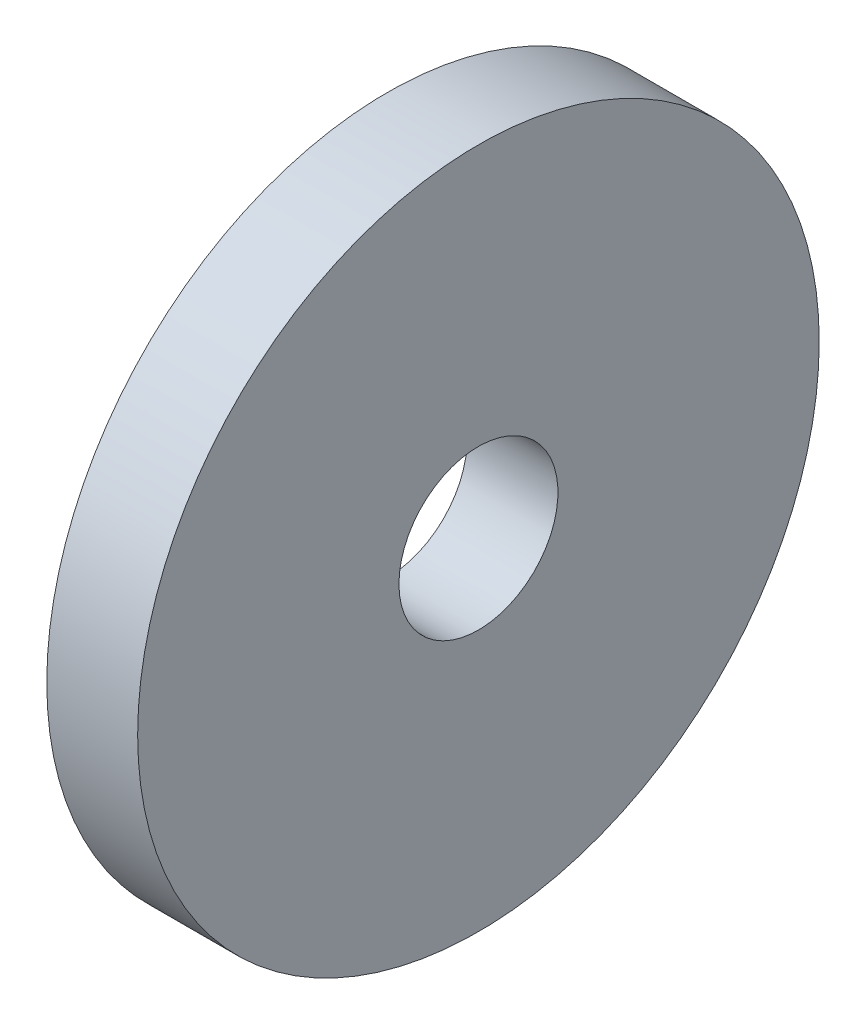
from build123d import *

# Parameters (mm, degrees)
ESQUISSE1_W = 4
ESQUISSE1_H = 11.5


with BuildPart() as part:
    # Esquisse1 → Base-R_volution (revolve)
    with BuildSketch(Plane.XY, mode=Mode.PRIVATE) as base_r_volution_sk:
        with Locations((2, 9.75)):
            Rectangle(ESQUISSE1_W, ESQUISSE1_H)
    revolve(base_r_volution_sk.sketch.rotate(Axis((-12.574722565, 0.5, 0), (1, 0, 0)), 90), axis=Axis((-12.574722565, 0.5, 0), (1, 0, 0)))


solid = part.part
